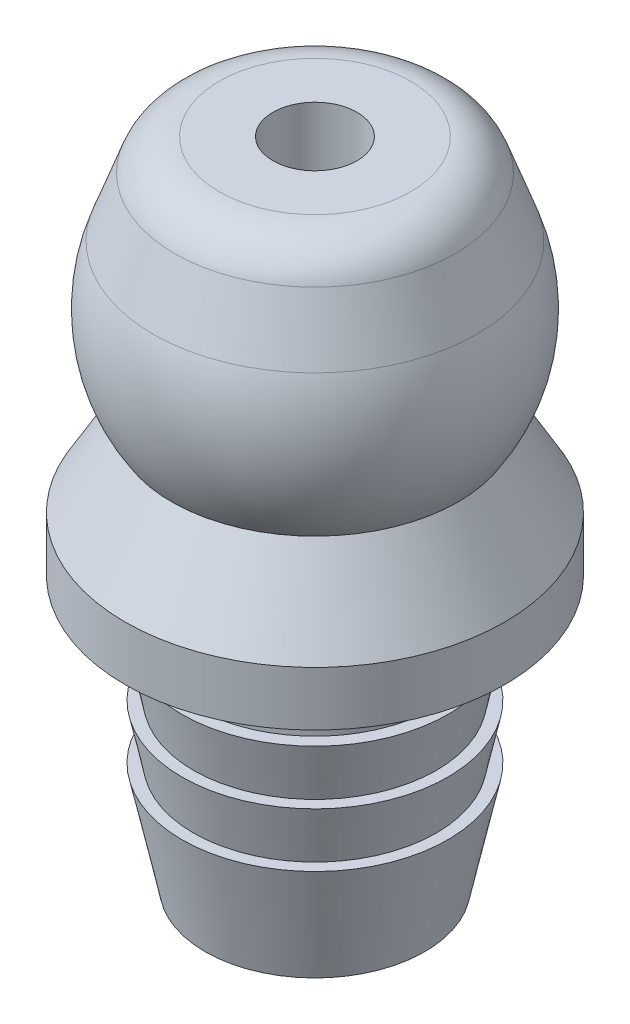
from build123d import *


with BuildPart() as part:
    # Sketch1 → Revolve1 (revolve)
    with BuildSketch(Plane.XY, mode=Mode.PRIVATE) as revolve1_sk:
        with BuildLine():
            Line((0.7874, 0), (0.7874, -1.27))
            Line((0.7874, -1.27), (0.889, -1.27))
            Line((0.889, -1.27), (0.889, -12.192))
            Line((0.889, -12.192), (2.057285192, -12.192))
            Line((2.057285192, -12.192), (2.4892, -10.16))
            Line((2.4892, -10.16), (2.273242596, -10.16))
            Line((2.273242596, -10.16), (2.4892, -9.144))
            Line((2.4892, -9.144), (2.273242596, -9.144))
            Line((2.273242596, -9.144), (2.4892, -8.128))
            Line((2.4892, -8.128), (2.2606, -8.128))
            Line((2.2606, -8.128), (2.2606, -7.112))
            Line((2.2606, -7.112), (3.556, -7.112))
            Line((3.556, -7.112), (3.556, -6.096))
            Line((3.556, -6.096), (2.683301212, -4.584441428))
            ThreePointArc((2.683301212, -4.584441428), (3.202728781, -3.179115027), (3.031260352, -1.690711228))
            Line((3.031260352, -1.690711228), (2.628794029, -0.584944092))
            ThreePointArc((2.628794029, -0.584944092), (2.303316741, -0.160773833), (1.793407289, 0))
            Line((1.793407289, 0), (0.7874, 0))
        make_face()
    revolve(revolve1_sk.sketch.rotate(Axis((0, 0, 0), (0, -1, 0)), 90), axis=Axis((0, 0, 0), (0, -1, 0)))


solid = part.part
